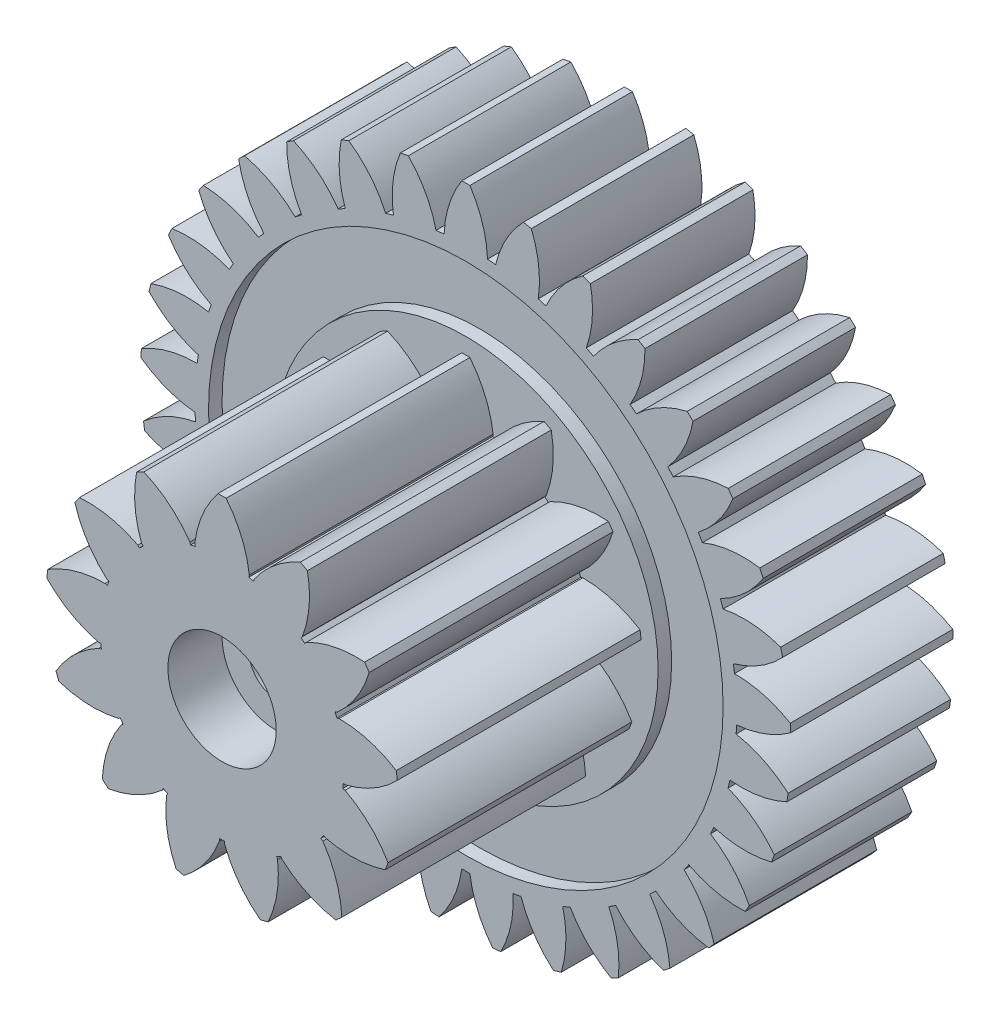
from build123d import *

# Parameters (mm, degrees)
ESQUISSE1_R                  = 12
BASE_EXTRUSION_DEPTH         = 6
ESQUISSE2_R                  = 6.5
BOSS_EXTRU_1_DEPTH           = 9
ENL_V_START                  = -9
ENL_V_MAT_EXTRU_1_DEPTH      = 9
R_P_TITION_CIRCULAIRE1_COUNT = 13
ENL_V_MAT_EXTRU_2_DEPTH      = 20.209372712
R_P_TITION_CIRCULAIRE2_COUNT = 33
ESQUISSE5_R                  = 1
ENL_V_MAT_EXTRU_3_DEPTH      = 23.645588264
ESQUISSE6_R                  = 2.25
ESQUISSE6_R_2                = 1
EXTRUSION1_DEPTH             = 0.5
ESQUISSE7_R                  = 9.5
ESQUISSE7_R_2                = 7.1
ENL_V_MAT_EXTRU_4_DEPTH      = 0.5
ESQUISSE9_R                  = 2
ENL_V_MAT_EXTRU_5_DEPTH      = 2


with BuildPart() as part:
    # Esquisse1 → Base-Extrusion (new body)
    with BuildSketch(Plane.XY):
        Circle(ESQUISSE1_R)
    extrude(amount=BASE_EXTRUSION_DEPTH)

    # Esquisse2 → Boss.-Extru.1 (add)
    with BuildSketch(Plane.XY.offset(6)):
        Circle(ESQUISSE2_R)
    extrude(amount=BOSS_EXTRU_1_DEPTH)

    # Esquisse3 → Enl_v. mat.-Extru.1 (cut)
    with BuildSketch(Plane.XY.offset(15).offset(ENL_V_START)):
        with BuildLine():
            Line((1.164685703, 4.346666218), (2.300774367, 8.586606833))
            Line((2.300774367, 8.586606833), (-2.300774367, 8.586606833))
            Line((-2.300774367, 8.586606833), (-1.164685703, 4.346666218))
            ThreePointArc((-1.164685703, 4.346666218), (-1.091273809, 4.365675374), (-1.017552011, 4.383444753))
            ThreePointArc((-1.017552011, 4.383444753), (-0.738060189, 5.504147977), (-0.15, 6.498269))
            ThreePointArc((-0.15, 6.498269), (0, 6.5), (0.15, 6.498269))
            ThreePointArc((0.15, 6.498269), (0.738060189, 5.504147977), (1.017552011, 4.383444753))
            ThreePointArc((1.017552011, 4.383444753), (1.091273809, 4.365675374), (1.164685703, 4.346666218))
        make_face()
    enl_v_mat_extru_1 = extrude(amount=ENL_V_MAT_EXTRU_1_DEPTH, mode=Mode.SUBTRACT)

    # R_p_tition circulaire1: Enl_v. mat.-Extru.1 ×13 about axis
    r_p_tition_circulaire1_axis = Axis((0, 0, 0), (0, 0, 1))
    for i in range(1, R_P_TITION_CIRCULAIRE1_COUNT):
        add(enl_v_mat_extru_1.rotate(r_p_tition_circulaire1_axis, i * 360 / R_P_TITION_CIRCULAIRE1_COUNT), mode=Mode.SUBTRACT)

    # Esquisse4 → Enl_v. mat.-Extru.2 (cut, through all)
    with BuildSketch(Plane.XY.offset(6)):
        with BuildLine():
            Line((0.950560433, 9.954719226), (1.42578926, 14.931540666))
            Line((1.42578926, 14.931540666), (-1.42578926, 14.931540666))
            Line((-1.42578926, 14.931540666), (-0.950560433, 9.954719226))
            ThreePointArc((-0.950560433, 9.954719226), (-0.875871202, 9.961568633), (-0.801132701, 9.967857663))
            ThreePointArc((-0.801132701, 9.967857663), (-0.613455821, 11.02766257), (-0.15, 11.999062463))
            ThreePointArc((-0.15, 11.999062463), (0, 12), (0.15, 11.999062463))
            ThreePointArc((0.15, 11.999062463), (0.613455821, 11.02766257), (0.801132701, 9.967857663))
            ThreePointArc((0.801132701, 9.967857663), (0.875871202, 9.961568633), (0.950560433, 9.954719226))
        make_face()
    enl_v_mat_extru_2 = extrude(amount=-ENL_V_MAT_EXTRU_2_DEPTH, mode=Mode.SUBTRACT)

    # R_p_tition circulaire2: Enl_v. mat.-Extru.2 ×33 about axis
    r_p_tition_circulaire2_axis = Axis((0, 0, 0), (0, 0, 1))
    for i in range(1, R_P_TITION_CIRCULAIRE2_COUNT):
        add(enl_v_mat_extru_2.rotate(r_p_tition_circulaire2_axis, i * 360 / R_P_TITION_CIRCULAIRE2_COUNT), mode=Mode.SUBTRACT)

    # Esquisse5 → Enl_v. mat.-Extru.3 (cut, through all)
    with BuildSketch(Plane.XY.offset(15)):
        Circle(ESQUISSE5_R)
    extrude(amount=-ENL_V_MAT_EXTRU_3_DEPTH, mode=Mode.SUBTRACT)

    # Esquisse6 → Extrusion1 (add)
    with BuildSketch(Plane(origin=(0, 0, 0), x_dir=(-1, 0, 0), z_dir=(0, 0, -1))):
        with Locations(Location((0, 0, 0), (0, 0, 180))):
            Circle(ESQUISSE6_R)
        with Locations(Location((0, 0, 0), (0, 0, 180))):
            Circle(ESQUISSE6_R_2, mode=Mode.SUBTRACT)
    extrude(amount=EXTRUSION1_DEPTH)

    # Esquisse7 → Enl_v. mat.-Extru.4 (cut)
    with BuildSketch(Plane.XY.offset(6)):
        Circle(ESQUISSE7_R)
        Circle(ESQUISSE7_R_2, mode=Mode.SUBTRACT)
    extrude(amount=-ENL_V_MAT_EXTRU_4_DEPTH, mode=Mode.SUBTRACT)

    # Esquisse9 → Enl_v. mat.-Extru.5 (cut)
    with BuildSketch(Plane.XY.offset(15)):
        Circle(ESQUISSE9_R)
    extrude(amount=-ENL_V_MAT_EXTRU_5_DEPTH, mode=Mode.SUBTRACT)


solid = part.part
